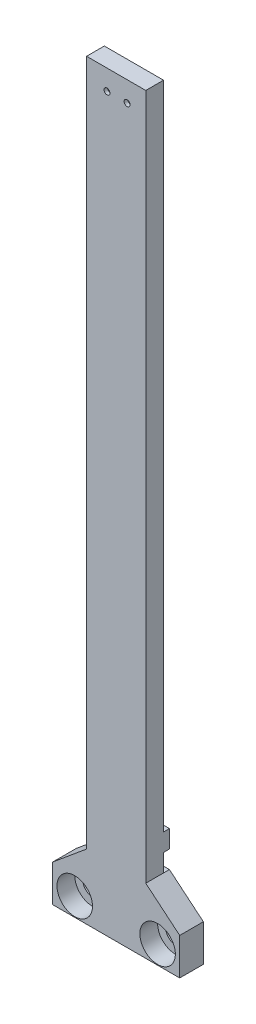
ISO-10303-21;
HEADER;
FILE_DESCRIPTION(('STEP AP214'),'2;1');
FILE_NAME('part.step','',(''),(''),'','','');
FILE_SCHEMA(('AUTOMOTIVE_DESIGN { 1 0 10303 214 1 1 1 1 }'));
ENDSEC;
DATA;
#1=APPLICATION_CONTEXT('core data for automotive mechanical design processes');
#2=APPLICATION_PROTOCOL_DEFINITION('international standard','automotive_design',2000,#1);
#3=PRODUCT_CONTEXT('',#1,'mechanical');
#4=PRODUCT('Part','Part','',(#3));
#5=PRODUCT_RELATED_PRODUCT_CATEGORY('part','',(#4));
#6=PRODUCT_DEFINITION_FORMATION('','',#4);
#7=PRODUCT_DEFINITION_CONTEXT('part definition',#1,'design');
#8=PRODUCT_DEFINITION('design','',#6,#7);
#9=PRODUCT_DEFINITION_SHAPE('','',#8);
#10=(LENGTH_UNIT() NAMED_UNIT(*) SI_UNIT(.MILLI.,.METRE.));
#11=(NAMED_UNIT(*) PLANE_ANGLE_UNIT() SI_UNIT($,.RADIAN.));
#12=(NAMED_UNIT(*) SI_UNIT($,.STERADIAN.) SOLID_ANGLE_UNIT());
#13=UNCERTAINTY_MEASURE_WITH_UNIT(LENGTH_MEASURE(1.E-05),#10,'distance_accuracy_value','');
#14=(GEOMETRIC_REPRESENTATION_CONTEXT(3) GLOBAL_UNCERTAINTY_ASSIGNED_CONTEXT((#13)) GLOBAL_UNIT_ASSIGNED_CONTEXT((#10,
#11,#12)) REPRESENTATION_CONTEXT('',''));
#15=CARTESIAN_POINT('',(0.,0.,0.));
#16=DIRECTION('',(0.,0.,1.));
#17=DIRECTION('',(1.,0.,0.));
#18=AXIS2_PLACEMENT_3D('',#15,#16,#17);
#19=CARTESIAN_POINT('',(5.,9.67931034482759,3.));
#20=DIRECTION('',(-1.,0.,0.));
#21=DIRECTION('',(0.,-1.,0.));
#22=AXIS2_PLACEMENT_3D('',#19,#20,#21);
#23=PLANE('',#22);
#24=DIRECTION('',(0.,0.,1.));
#25=VECTOR('',#24,1.);
#26=CARTESIAN_POINT('',(5.00000000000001,-106.320689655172,-1.));
#27=LINE('',#26,#25);
#28=CARTESIAN_POINT('',(5.00000000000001,-106.320689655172,0.));
#29=VERTEX_POINT('',#28);
#30=CARTESIAN_POINT('',(5.00000000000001,-106.320689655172,3.));
#31=VERTEX_POINT('',#30);
#32=EDGE_CURVE('E48',#29,#31,#27,.T.);
#33=ORIENTED_EDGE('',*,*,#32,.F.);
#34=DIRECTION('',(0.,1.,0.));
#35=VECTOR('',#34,1.);
#36=CARTESIAN_POINT('',(5.,9.67931034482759,0.));
#37=LINE('',#36,#35);
#38=CARTESIAN_POINT('',(5.00000000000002,-103.320689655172,0.));
#39=VERTEX_POINT('',#38);
#40=EDGE_CURVE('E303',#29,#39,#37,.T.);
#41=ORIENTED_EDGE('',*,*,#40,.T.);
#42=DIRECTION('',(0.,0.,1.));
#43=VECTOR('',#42,1.);
#44=CARTESIAN_POINT('',(5.00000000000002,-103.320689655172,-1.));
#45=LINE('',#44,#43);
#46=CARTESIAN_POINT('',(5.00000000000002,-103.320689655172,-1.));
#47=VERTEX_POINT('',#46);
#48=EDGE_CURVE('E250',#47,#39,#45,.T.);
#49=ORIENTED_EDGE('',*,*,#48,.F.);
#50=DIRECTION('',(0.,-1.,0.));
#51=VECTOR('',#50,1.);
#52=CARTESIAN_POINT('',(5.00000000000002,-100.320689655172,-1.));
#53=LINE('',#52,#51);
#54=CARTESIAN_POINT('',(5.00000000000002,-100.320689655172,-1.));
#55=VERTEX_POINT('',#54);
#56=EDGE_CURVE('E269',#55,#47,#53,.T.);
#57=ORIENTED_EDGE('',*,*,#56,.F.);
#58=DIRECTION('',(0.,0.,1.));
#59=VECTOR('',#58,1.);
#60=CARTESIAN_POINT('',(5.00000000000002,-100.320689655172,-1.));
#61=LINE('',#60,#59);
#62=CARTESIAN_POINT('',(5.00000000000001,-100.320689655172,0.));
#63=VERTEX_POINT('',#62);
#64=EDGE_CURVE('E262',#55,#63,#61,.T.);
#65=ORIENTED_EDGE('',*,*,#64,.T.);
#66=CARTESIAN_POINT('',(5.,9.67931034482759,0.));
#67=VERTEX_POINT('',#66);
#68=EDGE_CURVE('E302',#63,#67,#37,.T.);
#69=ORIENTED_EDGE('',*,*,#68,.T.);
#70=DIRECTION('',(0.,0.,-1.));
#71=VECTOR('',#70,1.);
#72=CARTESIAN_POINT('',(5.,9.67931034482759,3.));
#73=LINE('',#72,#71);
#74=CARTESIAN_POINT('',(5.,9.67931034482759,3.));
#75=VERTEX_POINT('',#74);
#76=EDGE_CURVE('E210',#75,#67,#73,.T.);
#77=ORIENTED_EDGE('',*,*,#76,.F.);
#78=DIRECTION('',(0.,1.,0.));
#79=VECTOR('',#78,1.);
#80=CARTESIAN_POINT('',(5.,9.67931034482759,3.));
#81=LINE('',#80,#79);
#82=EDGE_CURVE('E293',#31,#75,#81,.T.);
#83=ORIENTED_EDGE('',*,*,#82,.F.);
#84=EDGE_LOOP('',(#33,#41,#49,#57,#65,#69,#77,#83));
#85=FACE_BOUND('',#84,.T.);
#86=ADVANCED_FACE('F39',(#85),#23,.F.);
#87=CARTESIAN_POINT('',(0.,0.,0.));
#88=DIRECTION('',(0.,0.,1.));
#89=DIRECTION('',(1.,0.,0.));
#90=AXIS2_PLACEMENT_3D('',#87,#88,#89);
#91=PLANE('',#90);
#92=DIRECTION('',(-1.,0.,0.));
#93=VECTOR('',#92,1.);
#94=CARTESIAN_POINT('',(5.00000000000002,-103.320689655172,0.));
#95=LINE('',#94,#93);
#96=CARTESIAN_POINT('',(-5.,-103.320689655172,0.));
#97=VERTEX_POINT('',#96);
#98=EDGE_CURVE('E268',#39,#97,#95,.T.);
#99=ORIENTED_EDGE('',*,*,#98,.F.);
#100=ORIENTED_EDGE('',*,*,#40,.F.);
#101=DIRECTION('',(1.,0.,0.));
#102=VECTOR('',#101,1.);
#103=CARTESIAN_POINT('',(5.00000000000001,-106.320689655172,0.));
#104=LINE('',#103,#102);
#105=CARTESIAN_POINT('',(-5.,-106.320689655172,0.));
#106=VERTEX_POINT('',#105);
#107=EDGE_CURVE('E271',#106,#29,#104,.T.);
#108=ORIENTED_EDGE('',*,*,#107,.F.);
#109=DIRECTION('',(0.,-1.,0.));
#110=VECTOR('',#109,1.);
#111=CARTESIAN_POINT('',(-5.,9.67931034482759,0.));
#112=LINE('',#111,#110);
#113=EDGE_CURVE('E289',#97,#106,#112,.T.);
#114=ORIENTED_EDGE('',*,*,#113,.F.);
#115=EDGE_LOOP('',(#99,#100,#108,#114));
#116=FACE_BOUND('',#115,.T.);
#117=ADVANCED_FACE('F351',(#116),#91,.F.);
#118=DIRECTION('',(-1.,0.,0.));
#119=VECTOR('',#118,1.);
#120=CARTESIAN_POINT('',(1.32947358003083,3.89983090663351,0.));
#121=LINE('',#120,#119);
#122=CARTESIAN_POINT('',(1.32947358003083,3.89983090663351,0.));
#123=VERTEX_POINT('',#122);
#124=CARTESIAN_POINT('',(-1.32947358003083,3.89983090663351,0.));
#125=VERTEX_POINT('',#124);
#126=EDGE_CURVE('E240',#123,#125,#121,.T.);
#127=ORIENTED_EDGE('',*,*,#126,.F.);
#128=CARTESIAN_POINT('',(0.,6.24983090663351,0.));
#129=DIRECTION('',(0.,0.,-1.));
#130=DIRECTION('',(-1.,0.,0.));
#131=AXIS2_PLACEMENT_3D('',#128,#129,#130);
#132=CIRCLE('',#131,2.7);
#133=CARTESIAN_POINT('',(1.32947358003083,8.59983090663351,0.));
#134=VERTEX_POINT('',#133);
#135=EDGE_CURVE('E63',#134,#123,#132,.T.);
#136=ORIENTED_EDGE('',*,*,#135,.F.);
#137=DIRECTION('',(1.,0.,0.));
#138=VECTOR('',#137,1.);
#139=CARTESIAN_POINT('',(1.32947358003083,8.59983090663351,0.));
#140=LINE('',#139,#138);
#141=CARTESIAN_POINT('',(-1.32947358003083,8.59983090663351,0.));
#142=VERTEX_POINT('',#141);
#143=EDGE_CURVE('E229',#142,#134,#140,.T.);
#144=ORIENTED_EDGE('',*,*,#143,.F.);
#145=CARTESIAN_POINT('',(0.,6.24983090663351,0.));
#146=DIRECTION('',(0.,0.,-1.));
#147=DIRECTION('',(-1.,0.,0.));
#148=AXIS2_PLACEMENT_3D('',#145,#146,#147);
#149=CIRCLE('',#148,2.7);
#150=EDGE_CURVE('E243',#125,#142,#149,.T.);
#151=ORIENTED_EDGE('',*,*,#150,.F.);
#152=EDGE_LOOP('',(#127,#136,#144,#151));
#153=FACE_BOUND('',#152,.T.);
#154=DIRECTION('',(1.,0.,0.));
#155=VECTOR('',#154,1.);
#156=CARTESIAN_POINT('',(5.00000000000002,-100.320689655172,0.));
#157=LINE('',#156,#155);
#158=CARTESIAN_POINT('',(-5.,-100.320689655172,0.));
#159=VERTEX_POINT('',#158);
#160=EDGE_CURVE('E265',#159,#63,#157,.T.);
#161=ORIENTED_EDGE('',*,*,#160,.F.);
#162=CARTESIAN_POINT('',(-5.,9.67931034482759,0.));
#163=VERTEX_POINT('',#162);
#164=EDGE_CURVE('E299',#163,#159,#112,.T.);
#165=ORIENTED_EDGE('',*,*,#164,.F.);
#166=DIRECTION('',(-1.,0.,0.));
#167=VECTOR('',#166,1.);
#168=CARTESIAN_POINT('',(-5.,9.67931034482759,0.));
#169=LINE('',#168,#167);
#170=EDGE_CURVE('E294',#67,#163,#169,.T.);
#171=ORIENTED_EDGE('',*,*,#170,.F.);
#172=ORIENTED_EDGE('',*,*,#68,.F.);
#173=EDGE_LOOP('',(#161,#165,#171,#172));
#174=FACE_BOUND('',#173,.T.);
#175=ADVANCED_FACE('F356',(#153,#174),#91,.F.);
#176=CARTESIAN_POINT('',(-5.,9.67931034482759,3.));
#177=DIRECTION('',(1.,0.,0.));
#178=DIRECTION('',(0.,1.,0.));
#179=AXIS2_PLACEMENT_3D('',#176,#177,#178);
#180=PLANE('',#179);
#181=ORIENTED_EDGE('',*,*,#113,.T.);
#182=DIRECTION('',(0.,0.,1.));
#183=VECTOR('',#182,1.);
#184=CARTESIAN_POINT('',(-5.,-106.320689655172,-1.));
#185=LINE('',#184,#183);
#186=CARTESIAN_POINT('',(-4.99999999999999,-106.320689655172,3.));
#187=VERTEX_POINT('',#186);
#188=EDGE_CURVE('E11',#106,#187,#185,.T.);
#189=ORIENTED_EDGE('',*,*,#188,.T.);
#190=DIRECTION('',(0.,-1.,0.));
#191=VECTOR('',#190,1.);
#192=CARTESIAN_POINT('',(-5.,9.67931034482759,3.));
#193=LINE('',#192,#191);
#194=CARTESIAN_POINT('',(-5.,9.67931034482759,3.));
#195=VERTEX_POINT('',#194);
#196=EDGE_CURVE('E290',#195,#187,#193,.T.);
#197=ORIENTED_EDGE('',*,*,#196,.F.);
#198=DIRECTION('',(0.,0.,-1.));
#199=VECTOR('',#198,1.);
#200=CARTESIAN_POINT('',(-5.,9.67931034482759,3.));
#201=LINE('',#200,#199);
#202=EDGE_CURVE('E298',#195,#163,#201,.T.);
#203=ORIENTED_EDGE('',*,*,#202,.T.);
#204=ORIENTED_EDGE('',*,*,#164,.T.);
#205=DIRECTION('',(0.,0.,1.));
#206=VECTOR('',#205,1.);
#207=CARTESIAN_POINT('',(-5.,-100.320689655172,-1.));
#208=LINE('',#207,#206);
#209=CARTESIAN_POINT('',(-5.,-100.320689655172,-1.));
#210=VERTEX_POINT('',#209);
#211=EDGE_CURVE('E260',#210,#159,#208,.T.);
#212=ORIENTED_EDGE('',*,*,#211,.F.);
#213=DIRECTION('',(0.,1.,0.));
#214=VECTOR('',#213,1.);
#215=CARTESIAN_POINT('',(-5.,-100.320689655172,-1.));
#216=LINE('',#215,#214);
#217=CARTESIAN_POINT('',(-5.,-103.320689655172,-1.));
#218=VERTEX_POINT('',#217);
#219=EDGE_CURVE('E273',#218,#210,#216,.T.);
#220=ORIENTED_EDGE('',*,*,#219,.F.);
#221=DIRECTION('',(0.,0.,1.));
#222=VECTOR('',#221,1.);
#223=CARTESIAN_POINT('',(-5.,-103.320689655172,-1.));
#224=LINE('',#223,#222);
#225=EDGE_CURVE('E257',#218,#97,#224,.T.);
#226=ORIENTED_EDGE('',*,*,#225,.T.);
#227=EDGE_LOOP('',(#181,#189,#197,#203,#204,#212,#220,#226));
#228=FACE_BOUND('',#227,.T.);
#229=ADVANCED_FACE('F41',(#228),#180,.F.);
#230=CARTESIAN_POINT('',(-5.,9.67931034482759,3.));
#231=DIRECTION('',(0.,-1.,0.));
#232=DIRECTION('',(0.,0.,-1.));
#233=AXIS2_PLACEMENT_3D('',#230,#231,#232);
#234=PLANE('',#233);
#235=ORIENTED_EDGE('',*,*,#170,.T.);
#236=ORIENTED_EDGE('',*,*,#202,.F.);
#237=DIRECTION('',(-1.,0.,0.));
#238=VECTOR('',#237,1.);
#239=CARTESIAN_POINT('',(-5.,9.67931034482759,3.));
#240=LINE('',#239,#238);
#241=EDGE_CURVE('E296',#75,#195,#240,.T.);
#242=ORIENTED_EDGE('',*,*,#241,.F.);
#243=ORIENTED_EDGE('',*,*,#76,.T.);
#244=EDGE_LOOP('',(#235,#236,#242,#243));
#245=FACE_BOUND('',#244,.T.);
#246=ADVANCED_FACE('F360',(#245),#234,.F.);
#247=CARTESIAN_POINT('',(0.,0.,3.));
#248=DIRECTION('',(0.,0.,1.));
#249=DIRECTION('',(1.,0.,0.));
#250=AXIS2_PLACEMENT_3D('',#247,#248,#249);
#251=PLANE('',#250);
#252=CARTESIAN_POINT('',(7.,-114.204587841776,3.));
#253=DIRECTION('',(0.,0.,1.));
#254=DIRECTION('',(1.,0.,0.));
#255=AXIS2_PLACEMENT_3D('',#252,#253,#254);
#256=CIRCLE('',#255,3.);
#257=CARTESIAN_POINT('',(10.,-114.204587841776,3.));
#258=VERTEX_POINT('',#257);
#259=EDGE_CURVE('E326',#258,#258,#256,.T.);
#260=ORIENTED_EDGE('',*,*,#259,.F.);
#261=EDGE_LOOP('',(#260));
#262=FACE_BOUND('',#261,.T.);
#263=CARTESIAN_POINT('',(-7.,-114.204587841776,3.));
#264=DIRECTION('',(0.,0.,1.));
#265=DIRECTION('',(1.,0.,0.));
#266=AXIS2_PLACEMENT_3D('',#263,#264,#265);
#267=CIRCLE('',#266,3.);
#268=CARTESIAN_POINT('',(-4.,-114.204587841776,3.));
#269=VERTEX_POINT('',#268);
#270=EDGE_CURVE('E328',#269,#269,#267,.T.);
#271=ORIENTED_EDGE('',*,*,#270,.F.);
#272=EDGE_LOOP('',(#271));
#273=FACE_BOUND('',#272,.T.);
#274=DIRECTION('',(0.,1.,0.));
#275=VECTOR('',#274,1.);
#276=CARTESIAN_POINT('',(10.7336633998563,-111.088486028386,3.));
#277=LINE('',#276,#275);
#278=CARTESIAN_POINT('',(10.7336633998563,-117.320689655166,3.));
#279=VERTEX_POINT('',#278);
#280=CARTESIAN_POINT('',(10.7336633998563,-111.088486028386,3.));
#281=VERTEX_POINT('',#280);
#282=EDGE_CURVE('E196',#279,#281,#277,.T.);
#283=ORIENTED_EDGE('',*,*,#282,.T.);
#284=DIRECTION('',(-0.76889728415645,0.639372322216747,0.));
#285=VECTOR('',#284,1.);
#286=CARTESIAN_POINT('',(5.00000000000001,-106.320689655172,3.));
#287=LINE('',#286,#285);
#288=EDGE_CURVE('E201',#281,#31,#287,.T.);
#289=ORIENTED_EDGE('',*,*,#288,.T.);
#290=ORIENTED_EDGE('',*,*,#82,.T.);
#291=ORIENTED_EDGE('',*,*,#241,.T.);
#292=ORIENTED_EDGE('',*,*,#196,.T.);
#293=DIRECTION('',(-0.76889728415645,-0.639372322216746,0.));
#294=VECTOR('',#293,1.);
#295=CARTESIAN_POINT('',(-5.,-106.320689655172,3.));
#296=LINE('',#295,#294);
#297=CARTESIAN_POINT('',(-10.7336633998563,-111.088486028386,3.));
#298=VERTEX_POINT('',#297);
#299=EDGE_CURVE('E56',#187,#298,#296,.T.);
#300=ORIENTED_EDGE('',*,*,#299,.T.);
#301=DIRECTION('',(0.,-1.,0.));
#302=VECTOR('',#301,1.);
#303=CARTESIAN_POINT('',(-10.7336633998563,-111.088486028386,3.));
#304=LINE('',#303,#302);
#305=CARTESIAN_POINT('',(-10.7336633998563,-117.320689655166,3.));
#306=VERTEX_POINT('',#305);
#307=EDGE_CURVE('E194',#298,#306,#304,.T.);
#308=ORIENTED_EDGE('',*,*,#307,.T.);
#309=DIRECTION('',(1.,0.,0.));
#310=VECTOR('',#309,1.);
#311=CARTESIAN_POINT('',(-10.7336633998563,-117.320689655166,3.));
#312=LINE('',#311,#310);
#313=EDGE_CURVE('E178',#306,#279,#312,.T.);
#314=ORIENTED_EDGE('',*,*,#313,.T.);
#315=EDGE_LOOP('',(#283,#289,#290,#291,#292,#300,#308,#314));
#316=FACE_BOUND('',#315,.T.);
#317=CARTESIAN_POINT('',(1.85,6.24983090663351,3.));
#318=DIRECTION('',(0.,0.,1.));
#319=DIRECTION('',(1.,0.,0.));
#320=AXIS2_PLACEMENT_3D('',#317,#318,#319);
#321=CIRCLE('',#320,0.5);
#322=CARTESIAN_POINT('',(2.35,6.24983090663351,3.));
#323=VERTEX_POINT('',#322);
#324=EDGE_CURVE('E222',#323,#323,#321,.T.);
#325=ORIENTED_EDGE('',*,*,#324,.F.);
#326=EDGE_LOOP('',(#325));
#327=FACE_BOUND('',#326,.T.);
#328=CARTESIAN_POINT('',(-1.55,6.24983090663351,3.));
#329=DIRECTION('',(0.,0.,1.));
#330=DIRECTION('',(1.,0.,0.));
#331=AXIS2_PLACEMENT_3D('',#328,#329,#330);
#332=CIRCLE('',#331,0.5);
#333=CARTESIAN_POINT('',(-1.05,6.24983090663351,3.));
#334=VERTEX_POINT('',#333);
#335=EDGE_CURVE('E217',#334,#334,#332,.T.);
#336=ORIENTED_EDGE('',*,*,#335,.F.);
#337=EDGE_LOOP('',(#336));
#338=FACE_BOUND('',#337,.T.);
#339=ADVANCED_FACE('F362',(#262,#273,#316,#327,#338),#251,.T.);
#340=CARTESIAN_POINT('',(5.00000000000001,-106.320689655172,-1.));
#341=DIRECTION('',(0.,-1.,0.));
#342=DIRECTION('',(0.,0.,-1.));
#343=AXIS2_PLACEMENT_3D('',#340,#341,#342);
#344=PLANE('',#343);
#345=ORIENTED_EDGE('',*,*,#107,.T.);
#346=DIRECTION('',(0.,0.,1.));
#347=VECTOR('',#346,1.);
#348=CARTESIAN_POINT('',(5.00000000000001,-106.320689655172,-1.));
#349=LINE('',#348,#347);
#350=CARTESIAN_POINT('',(5.00000000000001,-106.320689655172,-1.));
#351=VERTEX_POINT('',#350);
#352=EDGE_CURVE('E281',#351,#29,#349,.T.);
#353=ORIENTED_EDGE('',*,*,#352,.F.);
#354=DIRECTION('',(1.,0.,0.));
#355=VECTOR('',#354,1.);
#356=CARTESIAN_POINT('',(5.00000000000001,-106.320689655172,-1.));
#357=LINE('',#356,#355);
#358=CARTESIAN_POINT('',(-5.,-106.320689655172,-1.));
#359=VERTEX_POINT('',#358);
#360=EDGE_CURVE('E279',#359,#351,#357,.T.);
#361=ORIENTED_EDGE('',*,*,#360,.F.);
#362=DIRECTION('',(0.,0.,1.));
#363=VECTOR('',#362,1.);
#364=CARTESIAN_POINT('',(-5.,-106.320689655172,-1.));
#365=LINE('',#364,#363);
#366=EDGE_CURVE('E286',#359,#106,#365,.T.);
#367=ORIENTED_EDGE('',*,*,#366,.T.);
#368=EDGE_LOOP('',(#345,#353,#361,#367));
#369=FACE_BOUND('',#368,.T.);
#370=ADVANCED_FACE('F367',(#369),#344,.F.);
#371=CARTESIAN_POINT('',(0.,0.,-1.));
#372=DIRECTION('',(0.,0.,-1.));
#373=DIRECTION('',(-1.,0.,0.));
#374=AXIS2_PLACEMENT_3D('',#371,#372,#373);
#375=PLANE('',#374);
#376=CARTESIAN_POINT('',(7.,-114.204587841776,-1.));
#377=DIRECTION('',(0.,0.,-1.));
#378=DIRECTION('',(-1.,0.,0.));
#379=AXIS2_PLACEMENT_3D('',#376,#377,#378);
#380=CIRCLE('',#379,1.625);
#381=CARTESIAN_POINT('',(5.375,-114.204587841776,-1.));
#382=VERTEX_POINT('',#381);
#383=EDGE_CURVE('E43',#382,#382,#380,.T.);
#384=ORIENTED_EDGE('',*,*,#383,.F.);
#385=EDGE_LOOP('',(#384));
#386=FACE_BOUND('',#385,.T.);
#387=CARTESIAN_POINT('',(-7.,-114.204587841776,-1.));
#388=DIRECTION('',(0.,0.,-1.));
#389=DIRECTION('',(-1.,0.,0.));
#390=AXIS2_PLACEMENT_3D('',#387,#388,#389);
#391=CIRCLE('',#390,1.625);
#392=CARTESIAN_POINT('',(-8.625,-114.204587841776,-1.));
#393=VERTEX_POINT('',#392);
#394=EDGE_CURVE('E310',#393,#393,#391,.T.);
#395=ORIENTED_EDGE('',*,*,#394,.F.);
#396=EDGE_LOOP('',(#395));
#397=FACE_BOUND('',#396,.T.);
#398=DIRECTION('',(1.,0.,0.));
#399=VECTOR('',#398,1.);
#400=CARTESIAN_POINT('',(-10.7336633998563,-117.320689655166,-1.));
#401=LINE('',#400,#399);
#402=CARTESIAN_POINT('',(-10.7336633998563,-117.320689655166,-1.));
#403=VERTEX_POINT('',#402);
#404=CARTESIAN_POINT('',(10.7336633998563,-117.320689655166,-1.));
#405=VERTEX_POINT('',#404);
#406=EDGE_CURVE('E176',#403,#405,#401,.T.);
#407=ORIENTED_EDGE('',*,*,#406,.F.);
#408=DIRECTION('',(0.,-1.,0.));
#409=VECTOR('',#408,1.);
#410=CARTESIAN_POINT('',(-10.7336633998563,-111.088486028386,-1.));
#411=LINE('',#410,#409);
#412=CARTESIAN_POINT('',(-10.7336633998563,-111.088486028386,-1.));
#413=VERTEX_POINT('',#412);
#414=EDGE_CURVE('E159',#413,#403,#411,.T.);
#415=ORIENTED_EDGE('',*,*,#414,.F.);
#416=DIRECTION('',(-0.76889728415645,-0.639372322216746,0.));
#417=VECTOR('',#416,1.);
#418=CARTESIAN_POINT('',(-5.,-106.320689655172,-1.));
#419=LINE('',#418,#417);
#420=EDGE_CURVE('E170',#359,#413,#419,.T.);
#421=ORIENTED_EDGE('',*,*,#420,.F.);
#422=ORIENTED_EDGE('',*,*,#360,.T.);
#423=DIRECTION('',(-0.76889728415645,0.639372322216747,0.));
#424=VECTOR('',#423,1.);
#425=CARTESIAN_POINT('',(5.00000000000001,-106.320689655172,-1.));
#426=LINE('',#425,#424);
#427=CARTESIAN_POINT('',(10.7336633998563,-111.088486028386,-1.));
#428=VERTEX_POINT('',#427);
#429=EDGE_CURVE('E200',#428,#351,#426,.T.);
#430=ORIENTED_EDGE('',*,*,#429,.F.);
#431=DIRECTION('',(0.,1.,0.));
#432=VECTOR('',#431,1.);
#433=CARTESIAN_POINT('',(10.7336633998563,-111.088486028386,-1.));
#434=LINE('',#433,#432);
#435=EDGE_CURVE('E183',#405,#428,#434,.T.);
#436=ORIENTED_EDGE('',*,*,#435,.F.);
#437=EDGE_LOOP('',(#407,#415,#421,#422,#430,#436));
#438=FACE_BOUND('',#437,.T.);
#439=ADVANCED_FACE('F181',(#386,#397,#438),#375,.T.);
#440=CARTESIAN_POINT('',(5.00000000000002,-103.320689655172,-1.));
#441=DIRECTION('',(0.,1.,0.));
#442=DIRECTION('',(0.,0.,1.));
#443=AXIS2_PLACEMENT_3D('',#440,#441,#442);
#444=PLANE('',#443);
#445=ORIENTED_EDGE('',*,*,#98,.T.);
#446=ORIENTED_EDGE('',*,*,#225,.F.);
#447=DIRECTION('',(-1.,0.,0.));
#448=VECTOR('',#447,1.);
#449=CARTESIAN_POINT('',(5.00000000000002,-103.320689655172,-1.));
#450=LINE('',#449,#448);
#451=EDGE_CURVE('E275',#47,#218,#450,.T.);
#452=ORIENTED_EDGE('',*,*,#451,.F.);
#453=ORIENTED_EDGE('',*,*,#48,.T.);
#454=EDGE_LOOP('',(#445,#446,#452,#453));
#455=FACE_BOUND('',#454,.T.);
#456=ADVANCED_FACE('F374',(#455),#444,.F.);
#457=CARTESIAN_POINT('',(5.00000000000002,-100.320689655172,-1.));
#458=DIRECTION('',(0.,-1.,0.));
#459=DIRECTION('',(0.,0.,-1.));
#460=AXIS2_PLACEMENT_3D('',#457,#458,#459);
#461=PLANE('',#460);
#462=ORIENTED_EDGE('',*,*,#160,.T.);
#463=ORIENTED_EDGE('',*,*,#64,.F.);
#464=DIRECTION('',(1.,0.,0.));
#465=VECTOR('',#464,1.);
#466=CARTESIAN_POINT('',(5.00000000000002,-100.320689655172,-1.));
#467=LINE('',#466,#465);
#468=EDGE_CURVE('E264',#210,#55,#467,.T.);
#469=ORIENTED_EDGE('',*,*,#468,.F.);
#470=ORIENTED_EDGE('',*,*,#211,.T.);
#471=EDGE_LOOP('',(#462,#463,#469,#470));
#472=FACE_BOUND('',#471,.T.);
#473=ADVANCED_FACE('F380',(#472),#461,.F.);
#474=CARTESIAN_POINT('',(0.,0.,-1.));
#475=DIRECTION('',(0.,0.,-1.));
#476=DIRECTION('',(-1.,0.,0.));
#477=AXIS2_PLACEMENT_3D('',#474,#475,#476);
#478=PLANE('',#477);
#479=ORIENTED_EDGE('',*,*,#56,.T.);
#480=ORIENTED_EDGE('',*,*,#451,.T.);
#481=ORIENTED_EDGE('',*,*,#219,.T.);
#482=ORIENTED_EDGE('',*,*,#468,.T.);
#483=EDGE_LOOP('',(#479,#480,#481,#482));
#484=FACE_BOUND('',#483,.T.);
#485=ADVANCED_FACE('F376',(#484),#478,.T.);
#486=CARTESIAN_POINT('',(0.,6.24983090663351,2.4));
#487=DIRECTION('',(0.,0.,-1.));
#488=DIRECTION('',(-1.,0.,0.));
#489=AXIS2_PLACEMENT_3D('',#486,#487,#488);
#490=CYLINDRICAL_SURFACE('',#489,2.7);
#491=ORIENTED_EDGE('',*,*,#135,.T.);
#492=DIRECTION('',(0.,0.,-1.));
#493=VECTOR('',#492,1.);
#494=CARTESIAN_POINT('',(1.32947358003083,3.89983090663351,2.4));
#495=LINE('',#494,#493);
#496=CARTESIAN_POINT('',(1.32947358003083,3.89983090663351,2.4));
#497=VERTEX_POINT('',#496);
#498=EDGE_CURVE('E238',#497,#123,#495,.T.);
#499=ORIENTED_EDGE('',*,*,#498,.F.);
#500=CARTESIAN_POINT('',(0.,6.24983090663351,2.4));
#501=DIRECTION('',(0.,0.,-1.));
#502=DIRECTION('',(-1.,0.,0.));
#503=AXIS2_PLACEMENT_3D('',#500,#501,#502);
#504=CIRCLE('',#503,2.7);
#505=CARTESIAN_POINT('',(1.32947358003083,8.59983090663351,2.4));
#506=VERTEX_POINT('',#505);
#507=EDGE_CURVE('E225',#506,#497,#504,.T.);
#508=ORIENTED_EDGE('',*,*,#507,.F.);
#509=DIRECTION('',(0.,0.,-1.));
#510=VECTOR('',#509,1.);
#511=CARTESIAN_POINT('',(1.32947358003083,8.59983090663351,2.4));
#512=LINE('',#511,#510);
#513=EDGE_CURVE('E248',#506,#134,#512,.T.);
#514=ORIENTED_EDGE('',*,*,#513,.T.);
#515=EDGE_LOOP('',(#491,#499,#508,#514));
#516=FACE_BOUND('',#515,.T.);
#517=ADVANCED_FACE('F379',(#516),#490,.F.);
#518=CARTESIAN_POINT('',(1.32947358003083,8.59983090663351,2.4));
#519=DIRECTION('',(0.,1.,0.));
#520=DIRECTION('',(0.,0.,1.));
#521=AXIS2_PLACEMENT_3D('',#518,#519,#520);
#522=PLANE('',#521);
#523=ORIENTED_EDGE('',*,*,#143,.T.);
#524=ORIENTED_EDGE('',*,*,#513,.F.);
#525=DIRECTION('',(1.,0.,0.));
#526=VECTOR('',#525,1.);
#527=CARTESIAN_POINT('',(1.32947358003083,8.59983090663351,2.4));
#528=LINE('',#527,#526);
#529=CARTESIAN_POINT('',(-1.32947358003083,8.59983090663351,2.4));
#530=VERTEX_POINT('',#529);
#531=EDGE_CURVE('E235',#530,#506,#528,.T.);
#532=ORIENTED_EDGE('',*,*,#531,.F.);
#533=DIRECTION('',(0.,0.,-1.));
#534=VECTOR('',#533,1.);
#535=CARTESIAN_POINT('',(-1.32947358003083,8.59983090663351,2.4));
#536=LINE('',#535,#534);
#537=EDGE_CURVE('E251',#530,#142,#536,.T.);
#538=ORIENTED_EDGE('',*,*,#537,.T.);
#539=EDGE_LOOP('',(#523,#524,#532,#538));
#540=FACE_BOUND('',#539,.T.);
#541=ADVANCED_FACE('F390',(#540),#522,.F.);
#542=CARTESIAN_POINT('',(0.,6.24983090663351,2.4));
#543=DIRECTION('',(0.,0.,-1.));
#544=DIRECTION('',(-1.,0.,0.));
#545=AXIS2_PLACEMENT_3D('',#542,#543,#544);
#546=CYLINDRICAL_SURFACE('',#545,2.7);
#547=ORIENTED_EDGE('',*,*,#150,.T.);
#548=ORIENTED_EDGE('',*,*,#537,.F.);
#549=CARTESIAN_POINT('',(0.,6.24983090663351,2.4));
#550=DIRECTION('',(0.,0.,-1.));
#551=DIRECTION('',(-1.,0.,0.));
#552=AXIS2_PLACEMENT_3D('',#549,#550,#551);
#553=CIRCLE('',#552,2.7);
#554=CARTESIAN_POINT('',(-1.32947358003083,3.89983090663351,2.4));
#555=VERTEX_POINT('',#554);
#556=EDGE_CURVE('E232',#555,#530,#553,.T.);
#557=ORIENTED_EDGE('',*,*,#556,.F.);
#558=DIRECTION('',(0.,0.,-1.));
#559=VECTOR('',#558,1.);
#560=CARTESIAN_POINT('',(-1.32947358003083,3.89983090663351,2.4));
#561=LINE('',#560,#559);
#562=EDGE_CURVE('E253',#555,#125,#561,.T.);
#563=ORIENTED_EDGE('',*,*,#562,.T.);
#564=EDGE_LOOP('',(#547,#548,#557,#563));
#565=FACE_BOUND('',#564,.T.);
#566=ADVANCED_FACE('F395',(#565),#546,.F.);
#567=CARTESIAN_POINT('',(1.32947358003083,3.89983090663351,2.4));
#568=DIRECTION('',(0.,-1.,0.));
#569=DIRECTION('',(0.,0.,-1.));
#570=AXIS2_PLACEMENT_3D('',#567,#568,#569);
#571=PLANE('',#570);
#572=ORIENTED_EDGE('',*,*,#126,.T.);
#573=ORIENTED_EDGE('',*,*,#562,.F.);
#574=DIRECTION('',(-1.,0.,0.));
#575=VECTOR('',#574,1.);
#576=CARTESIAN_POINT('',(1.32947358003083,3.89983090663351,2.4));
#577=LINE('',#576,#575);
#578=EDGE_CURVE('E228',#497,#555,#577,.T.);
#579=ORIENTED_EDGE('',*,*,#578,.F.);
#580=ORIENTED_EDGE('',*,*,#498,.T.);
#581=EDGE_LOOP('',(#572,#573,#579,#580));
#582=FACE_BOUND('',#581,.T.);
#583=ADVANCED_FACE('F391',(#582),#571,.F.);
#584=CARTESIAN_POINT('',(0.,6.24983090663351,2.4));
#585=DIRECTION('',(0.,0.,-1.));
#586=DIRECTION('',(-1.,0.,0.));
#587=AXIS2_PLACEMENT_3D('',#584,#585,#586);
#588=PLANE('',#587);
#589=CARTESIAN_POINT('',(1.85,6.24983090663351,2.4));
#590=DIRECTION('',(0.,0.,-1.));
#591=DIRECTION('',(-1.,0.,0.));
#592=AXIS2_PLACEMENT_3D('',#589,#590,#591);
#593=CIRCLE('',#592,0.5);
#594=CARTESIAN_POINT('',(1.35,6.24983090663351,2.4));
#595=VERTEX_POINT('',#594);
#596=EDGE_CURVE('E214',#595,#595,#593,.T.);
#597=ORIENTED_EDGE('',*,*,#596,.F.);
#598=EDGE_LOOP('',(#597));
#599=FACE_BOUND('',#598,.T.);
#600=CARTESIAN_POINT('',(-1.55,6.24983090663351,2.4));
#601=DIRECTION('',(0.,0.,-1.));
#602=DIRECTION('',(-1.,0.,0.));
#603=AXIS2_PLACEMENT_3D('',#600,#601,#602);
#604=CIRCLE('',#603,0.5);
#605=CARTESIAN_POINT('',(-2.05,6.24983090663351,2.4));
#606=VERTEX_POINT('',#605);
#607=EDGE_CURVE('E213',#606,#606,#604,.T.);
#608=ORIENTED_EDGE('',*,*,#607,.F.);
#609=EDGE_LOOP('',(#608));
#610=FACE_BOUND('',#609,.T.);
#611=ORIENTED_EDGE('',*,*,#507,.T.);
#612=ORIENTED_EDGE('',*,*,#578,.T.);
#613=ORIENTED_EDGE('',*,*,#556,.T.);
#614=ORIENTED_EDGE('',*,*,#531,.T.);
#615=EDGE_LOOP('',(#611,#612,#613,#614));
#616=FACE_BOUND('',#615,.T.);
#617=ADVANCED_FACE('F394',(#599,#610,#616),#588,.T.);
#618=CARTESIAN_POINT('',(-1.55,6.24983090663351,6.4));
#619=DIRECTION('',(0.,0.,-1.));
#620=DIRECTION('',(-1.,0.,0.));
#621=AXIS2_PLACEMENT_3D('',#618,#619,#620);
#622=CYLINDRICAL_SURFACE('',#621,0.5);
#623=ORIENTED_EDGE('',*,*,#335,.T.);
#624=EDGE_LOOP('',(#623));
#625=FACE_BOUND('',#624,.T.);
#626=ORIENTED_EDGE('',*,*,#607,.T.);
#627=EDGE_LOOP('',(#626));
#628=FACE_BOUND('',#627,.T.);
#629=ADVANCED_FACE('F405',(#625,#628),#622,.F.);
#630=CARTESIAN_POINT('',(1.85,6.24983090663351,6.4));
#631=DIRECTION('',(0.,0.,-1.));
#632=DIRECTION('',(-1.,0.,0.));
#633=AXIS2_PLACEMENT_3D('',#630,#631,#632);
#634=CYLINDRICAL_SURFACE('',#633,0.5);
#635=ORIENTED_EDGE('',*,*,#324,.T.);
#636=EDGE_LOOP('',(#635));
#637=FACE_BOUND('',#636,.T.);
#638=ORIENTED_EDGE('',*,*,#596,.T.);
#639=EDGE_LOOP('',(#638));
#640=FACE_BOUND('',#639,.T.);
#641=ADVANCED_FACE('F409',(#637,#640),#634,.F.);
#642=CARTESIAN_POINT('',(5.00000000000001,-106.320689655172,-1.));
#643=DIRECTION('',(0.639372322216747,0.76889728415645,0.));
#644=DIRECTION('',(-0.76889728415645,0.639372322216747,0.));
#645=AXIS2_PLACEMENT_3D('',#642,#643,#644);
#646=PLANE('',#645);
#647=ORIENTED_EDGE('',*,*,#288,.F.);
#648=DIRECTION('',(0.,0.,1.));
#649=VECTOR('',#648,1.);
#650=CARTESIAN_POINT('',(10.7336633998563,-111.088486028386,-1.));
#651=LINE('',#650,#649);
#652=EDGE_CURVE('E204',#428,#281,#651,.T.);
#653=ORIENTED_EDGE('',*,*,#652,.F.);
#654=ORIENTED_EDGE('',*,*,#429,.T.);
#655=ORIENTED_EDGE('',*,*,#352,.T.);
#656=ORIENTED_EDGE('',*,*,#32,.T.);
#657=EDGE_LOOP('',(#647,#653,#654,#655,#656));
#658=FACE_BOUND('',#657,.T.);
#659=ADVANCED_FACE('F413',(#658),#646,.T.);
#660=CARTESIAN_POINT('',(10.7336633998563,-111.088486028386,-1.));
#661=DIRECTION('',(1.,0.,0.));
#662=DIRECTION('',(0.,0.,-1.));
#663=AXIS2_PLACEMENT_3D('',#660,#661,#662);
#664=PLANE('',#663);
#665=ORIENTED_EDGE('',*,*,#652,.T.);
#666=ORIENTED_EDGE('',*,*,#282,.F.);
#667=DIRECTION('',(0.,0.,1.));
#668=VECTOR('',#667,1.);
#669=CARTESIAN_POINT('',(10.7336633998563,-117.320689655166,-1.));
#670=LINE('',#669,#668);
#671=EDGE_CURVE('E179',#405,#279,#670,.T.);
#672=ORIENTED_EDGE('',*,*,#671,.F.);
#673=ORIENTED_EDGE('',*,*,#435,.T.);
#674=EDGE_LOOP('',(#665,#666,#672,#673));
#675=FACE_BOUND('',#674,.T.);
#676=ADVANCED_FACE('F415',(#675),#664,.T.);
#677=CARTESIAN_POINT('',(-10.7336633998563,-111.088486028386,-1.));
#678=DIRECTION('',(-1.,0.,0.));
#679=DIRECTION('',(0.,0.,1.));
#680=AXIS2_PLACEMENT_3D('',#677,#678,#679);
#681=PLANE('',#680);
#682=ORIENTED_EDGE('',*,*,#414,.T.);
#683=DIRECTION('',(0.,0.,1.));
#684=VECTOR('',#683,1.);
#685=CARTESIAN_POINT('',(-10.7336633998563,-117.320689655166,-1.));
#686=LINE('',#685,#684);
#687=EDGE_CURVE('E163',#403,#306,#686,.T.);
#688=ORIENTED_EDGE('',*,*,#687,.T.);
#689=ORIENTED_EDGE('',*,*,#307,.F.);
#690=DIRECTION('',(0.,0.,1.));
#691=VECTOR('',#690,1.);
#692=CARTESIAN_POINT('',(-10.7336633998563,-111.088486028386,-1.));
#693=LINE('',#692,#691);
#694=EDGE_CURVE('E165',#413,#298,#693,.T.);
#695=ORIENTED_EDGE('',*,*,#694,.F.);
#696=EDGE_LOOP('',(#682,#688,#689,#695));
#697=FACE_BOUND('',#696,.T.);
#698=ADVANCED_FACE('F161',(#697),#681,.T.);
#699=CARTESIAN_POINT('',(-5.,-106.320689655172,-1.));
#700=DIRECTION('',(-0.639372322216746,0.768897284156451,0.));
#701=DIRECTION('',(-0.768897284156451,-0.639372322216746,0.));
#702=AXIS2_PLACEMENT_3D('',#699,#700,#701);
#703=PLANE('',#702);
#704=ORIENTED_EDGE('',*,*,#299,.F.);
#705=ORIENTED_EDGE('',*,*,#188,.F.);
#706=ORIENTED_EDGE('',*,*,#366,.F.);
#707=ORIENTED_EDGE('',*,*,#420,.T.);
#708=ORIENTED_EDGE('',*,*,#694,.T.);
#709=EDGE_LOOP('',(#704,#705,#706,#707,#708));
#710=FACE_BOUND('',#709,.T.);
#711=ADVANCED_FACE('F347',(#710),#703,.T.);
#712=CARTESIAN_POINT('',(-10.7336633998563,-117.320689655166,-1.));
#713=DIRECTION('',(0.,-1.,0.));
#714=DIRECTION('',(0.,0.,-1.));
#715=AXIS2_PLACEMENT_3D('',#712,#713,#714);
#716=PLANE('',#715);
#717=ORIENTED_EDGE('',*,*,#313,.F.);
#718=ORIENTED_EDGE('',*,*,#687,.F.);
#719=ORIENTED_EDGE('',*,*,#406,.T.);
#720=ORIENTED_EDGE('',*,*,#671,.T.);
#721=EDGE_LOOP('',(#717,#718,#719,#720));
#722=FACE_BOUND('',#721,.T.);
#723=ADVANCED_FACE('F174',(#722),#716,.T.);
#724=CARTESIAN_POINT('',(-7.,-114.204587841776,0.));
#725=DIRECTION('',(0.,0.,1.));
#726=DIRECTION('',(1.,0.,0.));
#727=AXIS2_PLACEMENT_3D('',#724,#725,#726);
#728=CYLINDRICAL_SURFACE('',#727,3.);
#729=CARTESIAN_POINT('',(-7.,-114.204587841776,0.));
#730=DIRECTION('',(0.,0.,1.));
#731=DIRECTION('',(1.,0.,0.));
#732=AXIS2_PLACEMENT_3D('',#729,#730,#731);
#733=CIRCLE('',#732,3.);
#734=CARTESIAN_POINT('',(-4.,-114.204587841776,0.));
#735=VERTEX_POINT('',#734);
#736=EDGE_CURVE('E189',#735,#735,#733,.T.);
#737=ORIENTED_EDGE('',*,*,#736,.F.);
#738=EDGE_LOOP('',(#737));
#739=FACE_BOUND('',#738,.T.);
#740=ORIENTED_EDGE('',*,*,#270,.T.);
#741=EDGE_LOOP('',(#740));
#742=FACE_BOUND('',#741,.T.);
#743=ADVANCED_FACE('F337',(#739,#742),#728,.F.);
#744=CARTESIAN_POINT('',(-7.,-114.204587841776,0.));
#745=DIRECTION('',(0.,0.,1.));
#746=DIRECTION('',(1.,0.,0.));
#747=AXIS2_PLACEMENT_3D('',#744,#745,#746);
#748=PLANE('',#747);
#749=CARTESIAN_POINT('',(-7.,-114.204587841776,0.));
#750=DIRECTION('',(0.,0.,1.));
#751=DIRECTION('',(1.,0.,0.));
#752=AXIS2_PLACEMENT_3D('',#749,#750,#751);
#753=CIRCLE('',#752,1.625);
#754=CARTESIAN_POINT('',(-5.375,-114.204587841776,0.));
#755=VERTEX_POINT('',#754);
#756=EDGE_CURVE('E317',#755,#755,#753,.T.);
#757=ORIENTED_EDGE('',*,*,#756,.F.);
#758=EDGE_LOOP('',(#757));
#759=FACE_BOUND('',#758,.T.);
#760=ORIENTED_EDGE('',*,*,#736,.T.);
#761=EDGE_LOOP('',(#760));
#762=FACE_BOUND('',#761,.T.);
#763=ADVANCED_FACE('F335',(#759,#762),#748,.T.);
#764=CARTESIAN_POINT('',(7.,-114.204587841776,0.));
#765=DIRECTION('',(0.,0.,1.));
#766=DIRECTION('',(1.,0.,0.));
#767=AXIS2_PLACEMENT_3D('',#764,#765,#766);
#768=CYLINDRICAL_SURFACE('',#767,3.);
#769=CARTESIAN_POINT('',(7.,-114.204587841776,0.));
#770=DIRECTION('',(0.,0.,1.));
#771=DIRECTION('',(1.,0.,0.));
#772=AXIS2_PLACEMENT_3D('',#769,#770,#771);
#773=CIRCLE('',#772,3.);
#774=CARTESIAN_POINT('',(10.,-114.204587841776,0.));
#775=VERTEX_POINT('',#774);
#776=EDGE_CURVE('E186',#775,#775,#773,.T.);
#777=ORIENTED_EDGE('',*,*,#776,.F.);
#778=EDGE_LOOP('',(#777));
#779=FACE_BOUND('',#778,.T.);
#780=ORIENTED_EDGE('',*,*,#259,.T.);
#781=EDGE_LOOP('',(#780));
#782=FACE_BOUND('',#781,.T.);
#783=ADVANCED_FACE('F344',(#779,#782),#768,.F.);
#784=CARTESIAN_POINT('',(7.,-114.204587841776,0.));
#785=DIRECTION('',(0.,0.,1.));
#786=DIRECTION('',(1.,0.,0.));
#787=AXIS2_PLACEMENT_3D('',#784,#785,#786);
#788=PLANE('',#787);
#789=CARTESIAN_POINT('',(7.,-114.204587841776,0.));
#790=DIRECTION('',(0.,0.,1.));
#791=DIRECTION('',(1.,0.,0.));
#792=AXIS2_PLACEMENT_3D('',#789,#790,#791);
#793=CIRCLE('',#792,1.625);
#794=CARTESIAN_POINT('',(8.625,-114.204587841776,0.));
#795=VERTEX_POINT('',#794);
#796=EDGE_CURVE('E312',#795,#795,#793,.T.);
#797=ORIENTED_EDGE('',*,*,#796,.F.);
#798=EDGE_LOOP('',(#797));
#799=FACE_BOUND('',#798,.T.);
#800=ORIENTED_EDGE('',*,*,#776,.T.);
#801=EDGE_LOOP('',(#800));
#802=FACE_BOUND('',#801,.T.);
#803=ADVANCED_FACE('F461',(#799,#802),#788,.T.);
#804=CARTESIAN_POINT('',(-7.,-114.204587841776,-6.));
#805=DIRECTION('',(0.,0.,1.));
#806=DIRECTION('',(1.,0.,0.));
#807=AXIS2_PLACEMENT_3D('',#804,#805,#806);
#808=CYLINDRICAL_SURFACE('',#807,1.625);
#809=ORIENTED_EDGE('',*,*,#394,.T.);
#810=EDGE_LOOP('',(#809));
#811=FACE_BOUND('',#810,.T.);
#812=ORIENTED_EDGE('',*,*,#756,.T.);
#813=EDGE_LOOP('',(#812));
#814=FACE_BOUND('',#813,.T.);
#815=ADVANCED_FACE('F484',(#811,#814),#808,.F.);
#816=CARTESIAN_POINT('',(7.,-114.204587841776,-6.));
#817=DIRECTION('',(0.,0.,1.));
#818=DIRECTION('',(1.,0.,0.));
#819=AXIS2_PLACEMENT_3D('',#816,#817,#818);
#820=CYLINDRICAL_SURFACE('',#819,1.625);
#821=ORIENTED_EDGE('',*,*,#383,.T.);
#822=EDGE_LOOP('',(#821));
#823=FACE_BOUND('',#822,.T.);
#824=ORIENTED_EDGE('',*,*,#796,.T.);
#825=EDGE_LOOP('',(#824));
#826=FACE_BOUND('',#825,.T.);
#827=ADVANCED_FACE('F495',(#823,#826),#820,.F.);
#828=CLOSED_SHELL('',(#86,#117,#175,#229,#246,#339,#370,#439,#456,#473,#485,#517,#541,#566,#583,
#617,#629,#641,#659,#676,#698,#711,#723,#743,#763,#783,#803,#815,#827));
#829=MANIFOLD_SOLID_BREP('B2',#828);
#830=ADVANCED_BREP_SHAPE_REPRESENTATION('',(#18,#829),#14);
#831=SHAPE_DEFINITION_REPRESENTATION(#9,#830);
ENDSEC;
END-ISO-10303-21;
